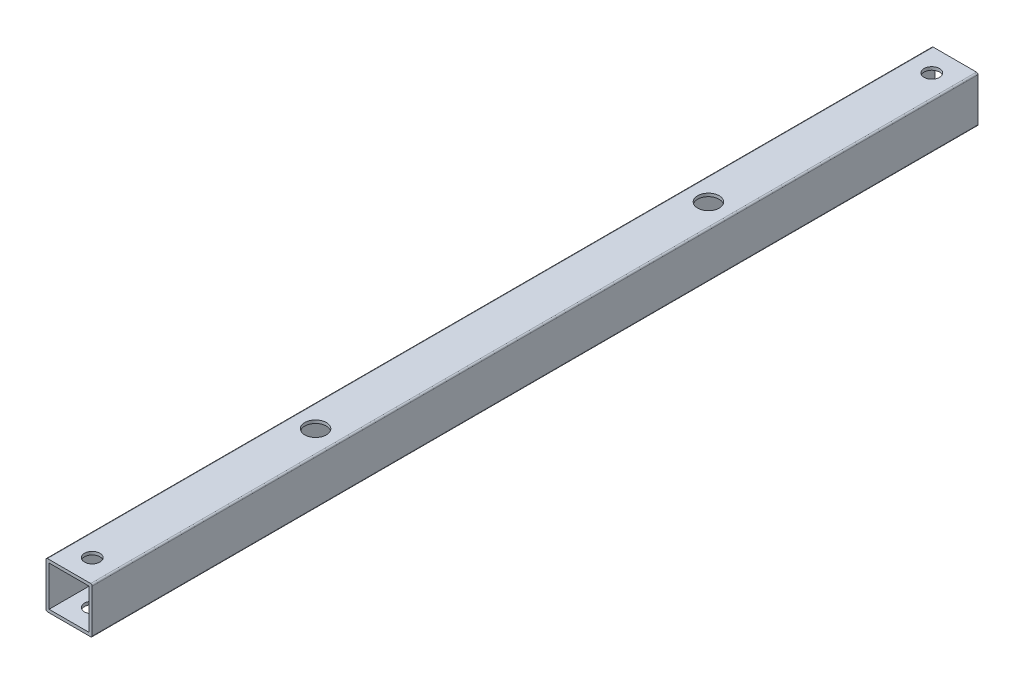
ISO-10303-21;
HEADER;
FILE_DESCRIPTION(('STEP AP214'),'2;1');
FILE_NAME('part.step','',(''),(''),'','','');
FILE_SCHEMA(('AUTOMOTIVE_DESIGN { 1 0 10303 214 1 1 1 1 }'));
ENDSEC;
DATA;
#1=APPLICATION_CONTEXT('core data for automotive mechanical design processes');
#2=APPLICATION_PROTOCOL_DEFINITION('international standard','automotive_design',2000,#1);
#3=PRODUCT_CONTEXT('',#1,'mechanical');
#4=PRODUCT('Part','Part','',(#3));
#5=PRODUCT_RELATED_PRODUCT_CATEGORY('part','',(#4));
#6=PRODUCT_DEFINITION_FORMATION('','',#4);
#7=PRODUCT_DEFINITION_CONTEXT('part definition',#1,'design');
#8=PRODUCT_DEFINITION('design','',#6,#7);
#9=PRODUCT_DEFINITION_SHAPE('','',#8);
#10=(LENGTH_UNIT() NAMED_UNIT(*) SI_UNIT(.MILLI.,.METRE.));
#11=(NAMED_UNIT(*) PLANE_ANGLE_UNIT() SI_UNIT($,.RADIAN.));
#12=(NAMED_UNIT(*) SI_UNIT($,.STERADIAN.) SOLID_ANGLE_UNIT());
#13=UNCERTAINTY_MEASURE_WITH_UNIT(LENGTH_MEASURE(1.E-05),#10,'distance_accuracy_value','');
#14=(GEOMETRIC_REPRESENTATION_CONTEXT(3) GLOBAL_UNCERTAINTY_ASSIGNED_CONTEXT((#13)) GLOBAL_UNIT_ASSIGNED_CONTEXT((#10,
#11,#12)) REPRESENTATION_CONTEXT('',''));
#15=CARTESIAN_POINT('',(0.,0.,0.));
#16=DIRECTION('',(0.,0.,1.));
#17=DIRECTION('',(1.,0.,0.));
#18=AXIS2_PLACEMENT_3D('',#15,#16,#17);
#19=CARTESIAN_POINT('',(-14.,-14.,575.));
#20=DIRECTION('',(0.,0.,-1.));
#21=DIRECTION('',(-1.,0.,0.));
#22=AXIS2_PLACEMENT_3D('',#19,#20,#21);
#23=PLANE('',#22);
#24=CARTESIAN_POINT('',(-14.,-14.,575.));
#25=DIRECTION('',(0.,0.,-1.));
#26=DIRECTION('',(-1.,0.,0.));
#27=AXIS2_PLACEMENT_3D('',#24,#25,#26);
#28=CIRCLE('',#27,0.999999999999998);
#29=CARTESIAN_POINT('',(-14.,-15.,575.));
#30=VERTEX_POINT('',#29);
#31=CARTESIAN_POINT('',(-15.,-14.,575.));
#32=VERTEX_POINT('',#31);
#33=EDGE_CURVE('E184',#30,#32,#28,.T.);
#34=ORIENTED_EDGE('',*,*,#33,.F.);
#35=DIRECTION('',(-1.,0.,0.));
#36=VECTOR('',#35,1.);
#37=CARTESIAN_POINT('',(14.,-15.,575.));
#38=LINE('',#37,#36);
#39=CARTESIAN_POINT('',(14.,-15.,575.));
#40=VERTEX_POINT('',#39);
#41=EDGE_CURVE('E202',#40,#30,#38,.T.);
#42=ORIENTED_EDGE('',*,*,#41,.F.);
#43=CARTESIAN_POINT('',(14.,-14.,575.));
#44=DIRECTION('',(0.,0.,-1.));
#45=DIRECTION('',(-1.,0.,0.));
#46=AXIS2_PLACEMENT_3D('',#43,#44,#45);
#47=CIRCLE('',#46,1.);
#48=CARTESIAN_POINT('',(15.,-14.,575.));
#49=VERTEX_POINT('',#48);
#50=EDGE_CURVE('E199',#49,#40,#47,.T.);
#51=ORIENTED_EDGE('',*,*,#50,.F.);
#52=DIRECTION('',(0.,1.,0.));
#53=VECTOR('',#52,1.);
#54=CARTESIAN_POINT('',(15.,-14.,575.));
#55=LINE('',#54,#53);
#56=CARTESIAN_POINT('',(15.,14.,575.));
#57=VERTEX_POINT('',#56);
#58=EDGE_CURVE('E197',#49,#57,#55,.T.);
#59=ORIENTED_EDGE('',*,*,#58,.T.);
#60=CARTESIAN_POINT('',(14.,14.,575.));
#61=DIRECTION('',(0.,0.,1.));
#62=DIRECTION('',(1.,0.,0.));
#63=AXIS2_PLACEMENT_3D('',#60,#61,#62);
#64=CIRCLE('',#63,0.999999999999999);
#65=CARTESIAN_POINT('',(14.,15.,575.));
#66=VERTEX_POINT('',#65);
#67=EDGE_CURVE('E195',#57,#66,#64,.T.);
#68=ORIENTED_EDGE('',*,*,#67,.T.);
#69=DIRECTION('',(1.,0.,0.));
#70=VECTOR('',#69,1.);
#71=CARTESIAN_POINT('',(-14.,15.,575.));
#72=LINE('',#71,#70);
#73=CARTESIAN_POINT('',(-14.,15.,575.));
#74=VERTEX_POINT('',#73);
#75=EDGE_CURVE('E192',#74,#66,#72,.T.);
#76=ORIENTED_EDGE('',*,*,#75,.F.);
#77=CARTESIAN_POINT('',(-14.,14.,575.));
#78=DIRECTION('',(0.,0.,-1.));
#79=DIRECTION('',(-1.,0.,0.));
#80=AXIS2_PLACEMENT_3D('',#77,#78,#79);
#81=CIRCLE('',#80,0.999999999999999);
#82=CARTESIAN_POINT('',(-15.,14.,575.));
#83=VERTEX_POINT('',#82);
#84=EDGE_CURVE('E189',#83,#74,#81,.T.);
#85=ORIENTED_EDGE('',*,*,#84,.F.);
#86=DIRECTION('',(0.,-1.,0.));
#87=VECTOR('',#86,1.);
#88=CARTESIAN_POINT('',(-15.,14.,575.));
#89=LINE('',#88,#87);
#90=EDGE_CURVE('E187',#83,#32,#89,.T.);
#91=ORIENTED_EDGE('',*,*,#90,.T.);
#92=EDGE_LOOP('',(#34,#42,#51,#59,#68,#76,#85,#91));
#93=FACE_BOUND('',#92,.T.);
#94=DIRECTION('',(0.,-1.,0.));
#95=VECTOR('',#94,1.);
#96=CARTESIAN_POINT('',(-13.,-14.,575.));
#97=LINE('',#96,#95);
#98=CARTESIAN_POINT('',(-13.,13.,575.));
#99=VERTEX_POINT('',#98);
#100=CARTESIAN_POINT('',(-13.,-13.,575.));
#101=VERTEX_POINT('',#100);
#102=EDGE_CURVE('E123',#99,#101,#97,.T.);
#103=ORIENTED_EDGE('',*,*,#102,.F.);
#104=DIRECTION('',(1.,0.,0.));
#105=VECTOR('',#104,1.);
#106=CARTESIAN_POINT('',(-14.,13.,575.));
#107=LINE('',#106,#105);
#108=CARTESIAN_POINT('',(13.,13.,575.));
#109=VERTEX_POINT('',#108);
#110=EDGE_CURVE('E155',#99,#109,#107,.T.);
#111=ORIENTED_EDGE('',*,*,#110,.T.);
#112=DIRECTION('',(0.,1.,0.));
#113=VECTOR('',#112,1.);
#114=CARTESIAN_POINT('',(13.,-14.,575.));
#115=LINE('',#114,#113);
#116=CARTESIAN_POINT('',(13.,-13.,575.));
#117=VERTEX_POINT('',#116);
#118=EDGE_CURVE('E153',#117,#109,#115,.T.);
#119=ORIENTED_EDGE('',*,*,#118,.F.);
#120=DIRECTION('',(-1.,0.,0.));
#121=VECTOR('',#120,1.);
#122=CARTESIAN_POINT('',(-14.,-13.,575.));
#123=LINE('',#122,#121);
#124=EDGE_CURVE('E151',#117,#101,#123,.T.);
#125=ORIENTED_EDGE('',*,*,#124,.T.);
#126=EDGE_LOOP('',(#103,#111,#119,#125));
#127=FACE_BOUND('',#126,.T.);
#128=ADVANCED_FACE('F30',(#93,#127),#23,.F.);
#129=CARTESIAN_POINT('',(-14.,-14.,0.));
#130=DIRECTION('',(0.,0.,-1.));
#131=DIRECTION('',(-1.,0.,0.));
#132=AXIS2_PLACEMENT_3D('',#129,#130,#131);
#133=PLANE('',#132);
#134=CARTESIAN_POINT('',(-14.,-14.,0.));
#135=DIRECTION('',(0.,0.,-1.));
#136=DIRECTION('',(-1.,0.,0.));
#137=AXIS2_PLACEMENT_3D('',#134,#135,#136);
#138=CIRCLE('',#137,0.999999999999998);
#139=CARTESIAN_POINT('',(-14.,-15.,0.));
#140=VERTEX_POINT('',#139);
#141=CARTESIAN_POINT('',(-15.,-14.,0.));
#142=VERTEX_POINT('',#141);
#143=EDGE_CURVE('E127',#140,#142,#138,.T.);
#144=ORIENTED_EDGE('',*,*,#143,.T.);
#145=DIRECTION('',(0.,-1.,0.));
#146=VECTOR('',#145,1.);
#147=CARTESIAN_POINT('',(-15.,14.,0.));
#148=LINE('',#147,#146);
#149=CARTESIAN_POINT('',(-15.,14.,0.));
#150=VERTEX_POINT('',#149);
#151=EDGE_CURVE('E164',#150,#142,#148,.T.);
#152=ORIENTED_EDGE('',*,*,#151,.F.);
#153=CARTESIAN_POINT('',(-14.,14.,0.));
#154=DIRECTION('',(0.,0.,-1.));
#155=DIRECTION('',(-1.,0.,0.));
#156=AXIS2_PLACEMENT_3D('',#153,#154,#155);
#157=CIRCLE('',#156,0.999999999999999);
#158=CARTESIAN_POINT('',(-14.,15.,0.));
#159=VERTEX_POINT('',#158);
#160=EDGE_CURVE('E167',#150,#159,#157,.T.);
#161=ORIENTED_EDGE('',*,*,#160,.T.);
#162=DIRECTION('',(1.,0.,0.));
#163=VECTOR('',#162,1.);
#164=CARTESIAN_POINT('',(-14.,15.,0.));
#165=LINE('',#164,#163);
#166=CARTESIAN_POINT('',(14.,15.,0.));
#167=VERTEX_POINT('',#166);
#168=EDGE_CURVE('E170',#159,#167,#165,.T.);
#169=ORIENTED_EDGE('',*,*,#168,.T.);
#170=CARTESIAN_POINT('',(14.,14.,0.));
#171=DIRECTION('',(0.,0.,1.));
#172=DIRECTION('',(1.,0.,0.));
#173=AXIS2_PLACEMENT_3D('',#170,#171,#172);
#174=CIRCLE('',#173,0.999999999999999);
#175=CARTESIAN_POINT('',(15.,14.,0.));
#176=VERTEX_POINT('',#175);
#177=EDGE_CURVE('E173',#176,#167,#174,.T.);
#178=ORIENTED_EDGE('',*,*,#177,.F.);
#179=DIRECTION('',(0.,1.,0.));
#180=VECTOR('',#179,1.);
#181=CARTESIAN_POINT('',(15.,-14.,0.));
#182=LINE('',#181,#180);
#183=CARTESIAN_POINT('',(15.,-14.,0.));
#184=VERTEX_POINT('',#183);
#185=EDGE_CURVE('E176',#184,#176,#182,.T.);
#186=ORIENTED_EDGE('',*,*,#185,.F.);
#187=CARTESIAN_POINT('',(14.,-14.,0.));
#188=DIRECTION('',(0.,0.,-1.));
#189=DIRECTION('',(-1.,0.,0.));
#190=AXIS2_PLACEMENT_3D('',#187,#188,#189);
#191=CIRCLE('',#190,1.);
#192=CARTESIAN_POINT('',(14.,-15.,0.));
#193=VERTEX_POINT('',#192);
#194=EDGE_CURVE('E178',#184,#193,#191,.T.);
#195=ORIENTED_EDGE('',*,*,#194,.T.);
#196=DIRECTION('',(-1.,0.,0.));
#197=VECTOR('',#196,1.);
#198=CARTESIAN_POINT('',(14.,-15.,0.));
#199=LINE('',#198,#197);
#200=EDGE_CURVE('E181',#193,#140,#199,.T.);
#201=ORIENTED_EDGE('',*,*,#200,.T.);
#202=EDGE_LOOP('',(#144,#152,#161,#169,#178,#186,#195,#201));
#203=FACE_BOUND('',#202,.T.);
#204=DIRECTION('',(1.,0.,0.));
#205=VECTOR('',#204,1.);
#206=CARTESIAN_POINT('',(-14.,13.,0.));
#207=LINE('',#206,#205);
#208=CARTESIAN_POINT('',(-13.,13.,0.));
#209=VERTEX_POINT('',#208);
#210=CARTESIAN_POINT('',(13.,13.,0.));
#211=VERTEX_POINT('',#210);
#212=EDGE_CURVE('E140',#209,#211,#207,.T.);
#213=ORIENTED_EDGE('',*,*,#212,.F.);
#214=DIRECTION('',(0.,-1.,0.));
#215=VECTOR('',#214,1.);
#216=CARTESIAN_POINT('',(-13.,-14.,0.));
#217=LINE('',#216,#215);
#218=CARTESIAN_POINT('',(-13.,-13.,0.));
#219=VERTEX_POINT('',#218);
#220=EDGE_CURVE('E55',#209,#219,#217,.T.);
#221=ORIENTED_EDGE('',*,*,#220,.T.);
#222=DIRECTION('',(-1.,0.,0.));
#223=VECTOR('',#222,1.);
#224=CARTESIAN_POINT('',(-14.,-13.,0.));
#225=LINE('',#224,#223);
#226=CARTESIAN_POINT('',(13.,-13.,0.));
#227=VERTEX_POINT('',#226);
#228=EDGE_CURVE('E131',#227,#219,#225,.T.);
#229=ORIENTED_EDGE('',*,*,#228,.F.);
#230=DIRECTION('',(0.,1.,0.));
#231=VECTOR('',#230,1.);
#232=CARTESIAN_POINT('',(13.,-14.,0.));
#233=LINE('',#232,#231);
#234=EDGE_CURVE('E136',#227,#211,#233,.T.);
#235=ORIENTED_EDGE('',*,*,#234,.T.);
#236=EDGE_LOOP('',(#213,#221,#229,#235));
#237=FACE_BOUND('',#236,.T.);
#238=ADVANCED_FACE('F139',(#203,#237),#133,.T.);
#239=CARTESIAN_POINT('',(-14.,-14.,575.));
#240=DIRECTION('',(0.,0.,-1.));
#241=DIRECTION('',(-1.,0.,0.));
#242=AXIS2_PLACEMENT_3D('',#239,#240,#241);
#243=CYLINDRICAL_SURFACE('',#242,0.999999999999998);
#244=ORIENTED_EDGE('',*,*,#143,.F.);
#245=DIRECTION('',(0.,0.,-1.));
#246=VECTOR('',#245,1.);
#247=CARTESIAN_POINT('',(-14.,-15.,575.));
#248=LINE('',#247,#246);
#249=EDGE_CURVE('E11',#30,#140,#248,.T.);
#250=ORIENTED_EDGE('',*,*,#249,.F.);
#251=ORIENTED_EDGE('',*,*,#33,.T.);
#252=DIRECTION('',(0.,0.,-1.));
#253=VECTOR('',#252,1.);
#254=CARTESIAN_POINT('',(-15.,-14.,575.));
#255=LINE('',#254,#253);
#256=EDGE_CURVE('E204',#32,#142,#255,.T.);
#257=ORIENTED_EDGE('',*,*,#256,.T.);
#258=EDGE_LOOP('',(#244,#250,#251,#257));
#259=FACE_BOUND('',#258,.T.);
#260=ADVANCED_FACE('F32',(#259),#243,.T.);
#261=CARTESIAN_POINT('',(14.,-15.,575.));
#262=DIRECTION('',(0.,-1.,0.));
#263=DIRECTION('',(1.,0.,0.));
#264=AXIS2_PLACEMENT_3D('',#261,#262,#263);
#265=PLANE('',#264);
#266=CARTESIAN_POINT('',(0.,-15.,415.));
#267=DIRECTION('',(0.,-1.,0.));
#268=DIRECTION('',(1.,0.,0.));
#269=AXIS2_PLACEMENT_3D('',#266,#267,#268);
#270=CIRCLE('',#269,5.);
#271=CARTESIAN_POINT('',(5.,-15.,415.));
#272=VERTEX_POINT('',#271);
#273=EDGE_CURVE('E244',#272,#272,#270,.T.);
#274=ORIENTED_EDGE('',*,*,#273,.F.);
#275=EDGE_LOOP('',(#274));
#276=FACE_BOUND('',#275,.T.);
#277=CARTESIAN_POINT('',(0.,-15.,560.));
#278=DIRECTION('',(0.,-1.,0.));
#279=DIRECTION('',(1.,0.,0.));
#280=AXIS2_PLACEMENT_3D('',#277,#278,#279);
#281=CIRCLE('',#280,5.);
#282=CARTESIAN_POINT('',(5.,-15.,560.));
#283=VERTEX_POINT('',#282);
#284=EDGE_CURVE('E235',#283,#283,#281,.T.);
#285=ORIENTED_EDGE('',*,*,#284,.F.);
#286=EDGE_LOOP('',(#285));
#287=FACE_BOUND('',#286,.T.);
#288=CARTESIAN_POINT('',(0.,-15.,160.));
#289=DIRECTION('',(0.,-1.,0.));
#290=DIRECTION('',(1.,0.,0.));
#291=AXIS2_PLACEMENT_3D('',#288,#289,#290);
#292=CIRCLE('',#291,5.);
#293=CARTESIAN_POINT('',(5.,-15.,160.));
#294=VERTEX_POINT('',#293);
#295=EDGE_CURVE('E225',#294,#294,#292,.T.);
#296=ORIENTED_EDGE('',*,*,#295,.F.);
#297=EDGE_LOOP('',(#296));
#298=FACE_BOUND('',#297,.T.);
#299=CARTESIAN_POINT('',(0.,-15.,15.));
#300=DIRECTION('',(0.,-1.,0.));
#301=DIRECTION('',(1.,0.,0.));
#302=AXIS2_PLACEMENT_3D('',#299,#300,#301);
#303=CIRCLE('',#302,5.);
#304=CARTESIAN_POINT('',(5.,-15.,15.));
#305=VERTEX_POINT('',#304);
#306=EDGE_CURVE('E141',#305,#305,#303,.T.);
#307=ORIENTED_EDGE('',*,*,#306,.F.);
#308=EDGE_LOOP('',(#307));
#309=FACE_BOUND('',#308,.T.);
#310=ORIENTED_EDGE('',*,*,#200,.F.);
#311=DIRECTION('',(0.,0.,-1.));
#312=VECTOR('',#311,1.);
#313=CARTESIAN_POINT('',(14.,-15.,575.));
#314=LINE('',#313,#312);
#315=EDGE_CURVE('E39',#40,#193,#314,.T.);
#316=ORIENTED_EDGE('',*,*,#315,.F.);
#317=ORIENTED_EDGE('',*,*,#41,.T.);
#318=ORIENTED_EDGE('',*,*,#249,.T.);
#319=EDGE_LOOP('',(#310,#316,#317,#318));
#320=FACE_BOUND('',#319,.T.);
#321=ADVANCED_FACE('F304',(#276,#287,#298,#309,#320),#265,.T.);
#322=CARTESIAN_POINT('',(14.,-14.,575.));
#323=DIRECTION('',(0.,0.,-1.));
#324=DIRECTION('',(-1.,0.,0.));
#325=AXIS2_PLACEMENT_3D('',#322,#323,#324);
#326=CYLINDRICAL_SURFACE('',#325,1.);
#327=ORIENTED_EDGE('',*,*,#194,.F.);
#328=DIRECTION('',(0.,0.,-1.));
#329=VECTOR('',#328,1.);
#330=CARTESIAN_POINT('',(15.,-14.,575.));
#331=LINE('',#330,#329);
#332=EDGE_CURVE('E207',#49,#184,#331,.T.);
#333=ORIENTED_EDGE('',*,*,#332,.F.);
#334=ORIENTED_EDGE('',*,*,#50,.T.);
#335=ORIENTED_EDGE('',*,*,#315,.T.);
#336=EDGE_LOOP('',(#327,#333,#334,#335));
#337=FACE_BOUND('',#336,.T.);
#338=ADVANCED_FACE('F301',(#337),#326,.T.);
#339=CARTESIAN_POINT('',(15.,-14.,575.));
#340=DIRECTION('',(-1.,0.,0.));
#341=DIRECTION('',(0.,-1.,0.));
#342=AXIS2_PLACEMENT_3D('',#339,#340,#341);
#343=PLANE('',#342);
#344=ORIENTED_EDGE('',*,*,#185,.T.);
#345=DIRECTION('',(0.,0.,-1.));
#346=VECTOR('',#345,1.);
#347=CARTESIAN_POINT('',(15.,14.,575.));
#348=LINE('',#347,#346);
#349=EDGE_CURVE('E209',#57,#176,#348,.T.);
#350=ORIENTED_EDGE('',*,*,#349,.F.);
#351=ORIENTED_EDGE('',*,*,#58,.F.);
#352=ORIENTED_EDGE('',*,*,#332,.T.);
#353=EDGE_LOOP('',(#344,#350,#351,#352));
#354=FACE_BOUND('',#353,.T.);
#355=ADVANCED_FACE('F328',(#354),#343,.F.);
#356=CARTESIAN_POINT('',(14.,14.,575.));
#357=DIRECTION('',(0.,0.,-1.));
#358=DIRECTION('',(-1.,0.,0.));
#359=AXIS2_PLACEMENT_3D('',#356,#357,#358);
#360=CYLINDRICAL_SURFACE('',#359,0.999999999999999);
#361=ORIENTED_EDGE('',*,*,#177,.T.);
#362=DIRECTION('',(0.,0.,-1.));
#363=VECTOR('',#362,1.);
#364=CARTESIAN_POINT('',(14.,15.,575.));
#365=LINE('',#364,#363);
#366=EDGE_CURVE('E212',#66,#167,#365,.T.);
#367=ORIENTED_EDGE('',*,*,#366,.F.);
#368=ORIENTED_EDGE('',*,*,#67,.F.);
#369=ORIENTED_EDGE('',*,*,#349,.T.);
#370=EDGE_LOOP('',(#361,#367,#368,#369));
#371=FACE_BOUND('',#370,.T.);
#372=ADVANCED_FACE('F270',(#371),#360,.T.);
#373=CARTESIAN_POINT('',(-14.,15.,575.));
#374=DIRECTION('',(0.,1.,0.));
#375=DIRECTION('',(0.,0.,1.));
#376=AXIS2_PLACEMENT_3D('',#373,#374,#375);
#377=PLANE('',#376);
#378=CARTESIAN_POINT('',(0.,15.,415.));
#379=DIRECTION('',(0.,1.,0.));
#380=DIRECTION('',(0.,0.,1.));
#381=AXIS2_PLACEMENT_3D('',#378,#379,#380);
#382=CIRCLE('',#381,7.);
#383=CARTESIAN_POINT('',(0.,15.,422.));
#384=VERTEX_POINT('',#383);
#385=EDGE_CURVE('E259',#384,#384,#382,.T.);
#386=ORIENTED_EDGE('',*,*,#385,.F.);
#387=EDGE_LOOP('',(#386));
#388=FACE_BOUND('',#387,.T.);
#389=CARTESIAN_POINT('',(0.,15.,160.));
#390=DIRECTION('',(0.,1.,0.));
#391=DIRECTION('',(0.,0.,1.));
#392=AXIS2_PLACEMENT_3D('',#389,#390,#391);
#393=CIRCLE('',#392,7.);
#394=CARTESIAN_POINT('',(0.,15.,167.));
#395=VERTEX_POINT('',#394);
#396=EDGE_CURVE('E253',#395,#395,#393,.T.);
#397=ORIENTED_EDGE('',*,*,#396,.F.);
#398=EDGE_LOOP('',(#397));
#399=FACE_BOUND('',#398,.T.);
#400=CARTESIAN_POINT('',(0.,15.,560.));
#401=DIRECTION('',(0.,1.,0.));
#402=DIRECTION('',(0.,0.,1.));
#403=AXIS2_PLACEMENT_3D('',#400,#401,#402);
#404=CIRCLE('',#403,5.);
#405=CARTESIAN_POINT('',(0.,15.,565.));
#406=VERTEX_POINT('',#405);
#407=EDGE_CURVE('E241',#406,#406,#404,.T.);
#408=ORIENTED_EDGE('',*,*,#407,.F.);
#409=EDGE_LOOP('',(#408));
#410=FACE_BOUND('',#409,.T.);
#411=CARTESIAN_POINT('',(0.,15.,15.));
#412=DIRECTION('',(0.,1.,0.));
#413=DIRECTION('',(0.,0.,1.));
#414=AXIS2_PLACEMENT_3D('',#411,#412,#413);
#415=CIRCLE('',#414,5.);
#416=CARTESIAN_POINT('',(0.,15.,20.));
#417=VERTEX_POINT('',#416);
#418=EDGE_CURVE('E220',#417,#417,#415,.T.);
#419=ORIENTED_EDGE('',*,*,#418,.F.);
#420=EDGE_LOOP('',(#419));
#421=FACE_BOUND('',#420,.T.);
#422=ORIENTED_EDGE('',*,*,#168,.F.);
#423=DIRECTION('',(0.,0.,-1.));
#424=VECTOR('',#423,1.);
#425=CARTESIAN_POINT('',(-14.,15.,575.));
#426=LINE('',#425,#424);
#427=EDGE_CURVE('E214',#74,#159,#426,.T.);
#428=ORIENTED_EDGE('',*,*,#427,.F.);
#429=ORIENTED_EDGE('',*,*,#75,.T.);
#430=ORIENTED_EDGE('',*,*,#366,.T.);
#431=EDGE_LOOP('',(#422,#428,#429,#430));
#432=FACE_BOUND('',#431,.T.);
#433=ADVANCED_FACE('F266',(#388,#399,#410,#421,#432),#377,.T.);
#434=CARTESIAN_POINT('',(-14.,14.,575.));
#435=DIRECTION('',(0.,0.,-1.));
#436=DIRECTION('',(-1.,0.,0.));
#437=AXIS2_PLACEMENT_3D('',#434,#435,#436);
#438=CYLINDRICAL_SURFACE('',#437,0.999999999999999);
#439=ORIENTED_EDGE('',*,*,#160,.F.);
#440=DIRECTION('',(0.,0.,-1.));
#441=VECTOR('',#440,1.);
#442=CARTESIAN_POINT('',(-15.,14.,575.));
#443=LINE('',#442,#441);
#444=EDGE_CURVE('E216',#83,#150,#443,.T.);
#445=ORIENTED_EDGE('',*,*,#444,.F.);
#446=ORIENTED_EDGE('',*,*,#84,.T.);
#447=ORIENTED_EDGE('',*,*,#427,.T.);
#448=EDGE_LOOP('',(#439,#445,#446,#447));
#449=FACE_BOUND('',#448,.T.);
#450=ADVANCED_FACE('F269',(#449),#438,.T.);
#451=CARTESIAN_POINT('',(-15.,14.,575.));
#452=DIRECTION('',(1.,0.,0.));
#453=DIRECTION('',(0.,1.,0.));
#454=AXIS2_PLACEMENT_3D('',#451,#452,#453);
#455=PLANE('',#454);
#456=ORIENTED_EDGE('',*,*,#151,.T.);
#457=ORIENTED_EDGE('',*,*,#256,.F.);
#458=ORIENTED_EDGE('',*,*,#90,.F.);
#459=ORIENTED_EDGE('',*,*,#444,.T.);
#460=EDGE_LOOP('',(#456,#457,#458,#459));
#461=FACE_BOUND('',#460,.T.);
#462=ADVANCED_FACE('F308',(#461),#455,.F.);
#463=CARTESIAN_POINT('',(-13.,-14.,575.));
#464=DIRECTION('',(1.,0.,0.));
#465=DIRECTION('',(0.,1.,0.));
#466=AXIS2_PLACEMENT_3D('',#463,#464,#465);
#467=PLANE('',#466);
#468=ORIENTED_EDGE('',*,*,#220,.F.);
#469=DIRECTION('',(0.,0.,-1.));
#470=VECTOR('',#469,1.);
#471=CARTESIAN_POINT('',(-13.,13.,575.));
#472=LINE('',#471,#470);
#473=EDGE_CURVE('E158',#99,#209,#472,.T.);
#474=ORIENTED_EDGE('',*,*,#473,.F.);
#475=ORIENTED_EDGE('',*,*,#102,.T.);
#476=DIRECTION('',(0.,0.,-1.));
#477=VECTOR('',#476,1.);
#478=CARTESIAN_POINT('',(-13.,-13.,575.));
#479=LINE('',#478,#477);
#480=EDGE_CURVE('E119',#101,#219,#479,.T.);
#481=ORIENTED_EDGE('',*,*,#480,.T.);
#482=EDGE_LOOP('',(#468,#474,#475,#481));
#483=FACE_BOUND('',#482,.T.);
#484=ADVANCED_FACE('F121',(#483),#467,.T.);
#485=CARTESIAN_POINT('',(-14.,-13.,575.));
#486=DIRECTION('',(0.,-1.,0.));
#487=DIRECTION('',(1.,0.,0.));
#488=AXIS2_PLACEMENT_3D('',#485,#486,#487);
#489=PLANE('',#488);
#490=CARTESIAN_POINT('',(0.,-13.,415.));
#491=DIRECTION('',(0.,-1.,0.));
#492=DIRECTION('',(1.,0.,0.));
#493=AXIS2_PLACEMENT_3D('',#490,#491,#492);
#494=CIRCLE('',#493,5.);
#495=CARTESIAN_POINT('',(5.,-13.,415.));
#496=VERTEX_POINT('',#495);
#497=EDGE_CURVE('E247',#496,#496,#494,.T.);
#498=ORIENTED_EDGE('',*,*,#497,.T.);
#499=EDGE_LOOP('',(#498));
#500=FACE_BOUND('',#499,.T.);
#501=CARTESIAN_POINT('',(0.,-13.,560.));
#502=DIRECTION('',(0.,-1.,0.));
#503=DIRECTION('',(1.,0.,0.));
#504=AXIS2_PLACEMENT_3D('',#501,#502,#503);
#505=CIRCLE('',#504,5.);
#506=CARTESIAN_POINT('',(5.,-13.,560.));
#507=VERTEX_POINT('',#506);
#508=EDGE_CURVE('E238',#507,#507,#505,.T.);
#509=ORIENTED_EDGE('',*,*,#508,.T.);
#510=EDGE_LOOP('',(#509));
#511=FACE_BOUND('',#510,.T.);
#512=CARTESIAN_POINT('',(0.,-13.,160.));
#513=DIRECTION('',(0.,-1.,0.));
#514=DIRECTION('',(1.,0.,0.));
#515=AXIS2_PLACEMENT_3D('',#512,#513,#514);
#516=CIRCLE('',#515,5.);
#517=CARTESIAN_POINT('',(5.,-13.,160.));
#518=VERTEX_POINT('',#517);
#519=EDGE_CURVE('E230',#518,#518,#516,.T.);
#520=ORIENTED_EDGE('',*,*,#519,.T.);
#521=EDGE_LOOP('',(#520));
#522=FACE_BOUND('',#521,.T.);
#523=CARTESIAN_POINT('',(0.,-13.,15.));
#524=DIRECTION('',(0.,-1.,0.));
#525=DIRECTION('',(1.,0.,0.));
#526=AXIS2_PLACEMENT_3D('',#523,#524,#525);
#527=CIRCLE('',#526,5.);
#528=CARTESIAN_POINT('',(5.,-13.,15.));
#529=VERTEX_POINT('',#528);
#530=EDGE_CURVE('E144',#529,#529,#527,.T.);
#531=ORIENTED_EDGE('',*,*,#530,.T.);
#532=EDGE_LOOP('',(#531));
#533=FACE_BOUND('',#532,.T.);
#534=ORIENTED_EDGE('',*,*,#228,.T.);
#535=ORIENTED_EDGE('',*,*,#480,.F.);
#536=ORIENTED_EDGE('',*,*,#124,.F.);
#537=DIRECTION('',(0.,0.,-1.));
#538=VECTOR('',#537,1.);
#539=CARTESIAN_POINT('',(13.,-13.,575.));
#540=LINE('',#539,#538);
#541=EDGE_CURVE('E128',#117,#227,#540,.T.);
#542=ORIENTED_EDGE('',*,*,#541,.T.);
#543=EDGE_LOOP('',(#534,#535,#536,#542));
#544=FACE_BOUND('',#543,.T.);
#545=ADVANCED_FACE('F132',(#500,#511,#522,#533,#544),#489,.F.);
#546=CARTESIAN_POINT('',(13.,-14.,575.));
#547=DIRECTION('',(-1.,0.,0.));
#548=DIRECTION('',(0.,-1.,0.));
#549=AXIS2_PLACEMENT_3D('',#546,#547,#548);
#550=PLANE('',#549);
#551=ORIENTED_EDGE('',*,*,#234,.F.);
#552=ORIENTED_EDGE('',*,*,#541,.F.);
#553=ORIENTED_EDGE('',*,*,#118,.T.);
#554=DIRECTION('',(0.,0.,-1.));
#555=VECTOR('',#554,1.);
#556=CARTESIAN_POINT('',(13.,13.,575.));
#557=LINE('',#556,#555);
#558=EDGE_CURVE('E47',#109,#211,#557,.T.);
#559=ORIENTED_EDGE('',*,*,#558,.T.);
#560=EDGE_LOOP('',(#551,#552,#553,#559));
#561=FACE_BOUND('',#560,.T.);
#562=ADVANCED_FACE('F363',(#561),#550,.T.);
#563=CARTESIAN_POINT('',(-14.,13.,575.));
#564=DIRECTION('',(0.,1.,0.));
#565=DIRECTION('',(0.,0.,1.));
#566=AXIS2_PLACEMENT_3D('',#563,#564,#565);
#567=PLANE('',#566);
#568=CARTESIAN_POINT('',(0.,13.,415.));
#569=DIRECTION('',(0.,1.,0.));
#570=DIRECTION('',(0.,0.,1.));
#571=AXIS2_PLACEMENT_3D('',#568,#569,#570);
#572=CIRCLE('',#571,7.);
#573=CARTESIAN_POINT('',(0.,13.,422.));
#574=VERTEX_POINT('',#573);
#575=EDGE_CURVE('E256',#574,#574,#572,.T.);
#576=ORIENTED_EDGE('',*,*,#575,.T.);
#577=EDGE_LOOP('',(#576));
#578=FACE_BOUND('',#577,.T.);
#579=CARTESIAN_POINT('',(0.,13.,160.));
#580=DIRECTION('',(0.,1.,0.));
#581=DIRECTION('',(0.,0.,1.));
#582=AXIS2_PLACEMENT_3D('',#579,#580,#581);
#583=CIRCLE('',#582,7.);
#584=CARTESIAN_POINT('',(0.,13.,167.));
#585=VERTEX_POINT('',#584);
#586=EDGE_CURVE('E250',#585,#585,#583,.T.);
#587=ORIENTED_EDGE('',*,*,#586,.T.);
#588=EDGE_LOOP('',(#587));
#589=FACE_BOUND('',#588,.T.);
#590=CARTESIAN_POINT('',(0.,13.,560.));
#591=DIRECTION('',(0.,1.,0.));
#592=DIRECTION('',(0.,0.,1.));
#593=AXIS2_PLACEMENT_3D('',#590,#591,#592);
#594=CIRCLE('',#593,5.);
#595=CARTESIAN_POINT('',(0.,13.,565.));
#596=VERTEX_POINT('',#595);
#597=EDGE_CURVE('E34',#596,#596,#594,.T.);
#598=ORIENTED_EDGE('',*,*,#597,.T.);
#599=EDGE_LOOP('',(#598));
#600=FACE_BOUND('',#599,.T.);
#601=CARTESIAN_POINT('',(0.,13.,15.));
#602=DIRECTION('',(0.,1.,0.));
#603=DIRECTION('',(0.,0.,1.));
#604=AXIS2_PLACEMENT_3D('',#601,#602,#603);
#605=CIRCLE('',#604,5.);
#606=CARTESIAN_POINT('',(0.,13.,20.));
#607=VERTEX_POINT('',#606);
#608=EDGE_CURVE('E218',#607,#607,#605,.T.);
#609=ORIENTED_EDGE('',*,*,#608,.T.);
#610=EDGE_LOOP('',(#609));
#611=FACE_BOUND('',#610,.T.);
#612=ORIENTED_EDGE('',*,*,#212,.T.);
#613=ORIENTED_EDGE('',*,*,#558,.F.);
#614=ORIENTED_EDGE('',*,*,#110,.F.);
#615=ORIENTED_EDGE('',*,*,#473,.T.);
#616=EDGE_LOOP('',(#612,#613,#614,#615));
#617=FACE_BOUND('',#616,.T.);
#618=ADVANCED_FACE('F368',(#578,#589,#600,#611,#617),#567,.F.);
#619=CARTESIAN_POINT('',(0.,-20.,15.));
#620=DIRECTION('',(0.,1.,0.));
#621=DIRECTION('',(0.,0.,1.));
#622=AXIS2_PLACEMENT_3D('',#619,#620,#621);
#623=CYLINDRICAL_SURFACE('',#622,5.);
#624=ORIENTED_EDGE('',*,*,#418,.T.);
#625=EDGE_LOOP('',(#624));
#626=FACE_BOUND('',#625,.T.);
#627=ORIENTED_EDGE('',*,*,#608,.F.);
#628=EDGE_LOOP('',(#627));
#629=FACE_BOUND('',#628,.T.);
#630=ADVANCED_FACE('F392',(#626,#629),#623,.F.);
#631=ORIENTED_EDGE('',*,*,#306,.T.);
#632=EDGE_LOOP('',(#631));
#633=FACE_BOUND('',#632,.T.);
#634=ORIENTED_EDGE('',*,*,#530,.F.);
#635=EDGE_LOOP('',(#634));
#636=FACE_BOUND('',#635,.T.);
#637=ADVANCED_FACE('F397',(#633,#636),#623,.F.);
#638=CARTESIAN_POINT('',(0.,-20.,160.));
#639=DIRECTION('',(0.,1.,0.));
#640=DIRECTION('',(0.,0.,1.));
#641=AXIS2_PLACEMENT_3D('',#638,#639,#640);
#642=CYLINDRICAL_SURFACE('',#641,5.);
#643=ORIENTED_EDGE('',*,*,#295,.T.);
#644=EDGE_LOOP('',(#643));
#645=FACE_BOUND('',#644,.T.);
#646=ORIENTED_EDGE('',*,*,#519,.F.);
#647=EDGE_LOOP('',(#646));
#648=FACE_BOUND('',#647,.T.);
#649=ADVANCED_FACE('F406',(#645,#648),#642,.F.);
#650=CARTESIAN_POINT('',(0.,-20.,560.));
#651=DIRECTION('',(0.,1.,0.));
#652=DIRECTION('',(0.,0.,1.));
#653=AXIS2_PLACEMENT_3D('',#650,#651,#652);
#654=CYLINDRICAL_SURFACE('',#653,5.);
#655=ORIENTED_EDGE('',*,*,#407,.T.);
#656=EDGE_LOOP('',(#655));
#657=FACE_BOUND('',#656,.T.);
#658=ORIENTED_EDGE('',*,*,#597,.F.);
#659=EDGE_LOOP('',(#658));
#660=FACE_BOUND('',#659,.T.);
#661=ADVANCED_FACE('F415',(#657,#660),#654,.F.);
#662=ORIENTED_EDGE('',*,*,#284,.T.);
#663=EDGE_LOOP('',(#662));
#664=FACE_BOUND('',#663,.T.);
#665=ORIENTED_EDGE('',*,*,#508,.F.);
#666=EDGE_LOOP('',(#665));
#667=FACE_BOUND('',#666,.T.);
#668=ADVANCED_FACE('F425',(#664,#667),#654,.F.);
#669=CARTESIAN_POINT('',(0.,-20.,415.));
#670=DIRECTION('',(0.,1.,0.));
#671=DIRECTION('',(0.,0.,1.));
#672=AXIS2_PLACEMENT_3D('',#669,#670,#671);
#673=CYLINDRICAL_SURFACE('',#672,5.);
#674=ORIENTED_EDGE('',*,*,#273,.T.);
#675=EDGE_LOOP('',(#674));
#676=FACE_BOUND('',#675,.T.);
#677=ORIENTED_EDGE('',*,*,#497,.F.);
#678=EDGE_LOOP('',(#677));
#679=FACE_BOUND('',#678,.T.);
#680=ADVANCED_FACE('F434',(#676,#679),#673,.F.);
#681=CARTESIAN_POINT('',(0.,12.,160.));
#682=DIRECTION('',(0.,1.,0.));
#683=DIRECTION('',(0.,0.,1.));
#684=AXIS2_PLACEMENT_3D('',#681,#682,#683);
#685=CYLINDRICAL_SURFACE('',#684,7.);
#686=ORIENTED_EDGE('',*,*,#396,.T.);
#687=EDGE_LOOP('',(#686));
#688=FACE_BOUND('',#687,.T.);
#689=ORIENTED_EDGE('',*,*,#586,.F.);
#690=EDGE_LOOP('',(#689));
#691=FACE_BOUND('',#690,.T.);
#692=ADVANCED_FACE('F442',(#688,#691),#685,.F.);
#693=CARTESIAN_POINT('',(0.,12.,415.));
#694=DIRECTION('',(0.,1.,0.));
#695=DIRECTION('',(0.,0.,1.));
#696=AXIS2_PLACEMENT_3D('',#693,#694,#695);
#697=CYLINDRICAL_SURFACE('',#696,7.);
#698=ORIENTED_EDGE('',*,*,#385,.T.);
#699=EDGE_LOOP('',(#698));
#700=FACE_BOUND('',#699,.T.);
#701=ORIENTED_EDGE('',*,*,#575,.F.);
#702=EDGE_LOOP('',(#701));
#703=FACE_BOUND('',#702,.T.);
#704=ADVANCED_FACE('F263',(#700,#703),#697,.F.);
#705=CLOSED_SHELL('',(#128,#238,#260,#321,#338,#355,#372,#433,#450,#462,#484,#545,#562,#618,
#630,#637,#649,#661,#668,#680,#692,#704));
#706=MANIFOLD_SOLID_BREP('B2',#705);
#707=ADVANCED_BREP_SHAPE_REPRESENTATION('',(#18,#706),#14);
#708=SHAPE_DEFINITION_REPRESENTATION(#9,#707);
ENDSEC;
END-ISO-10303-21;
